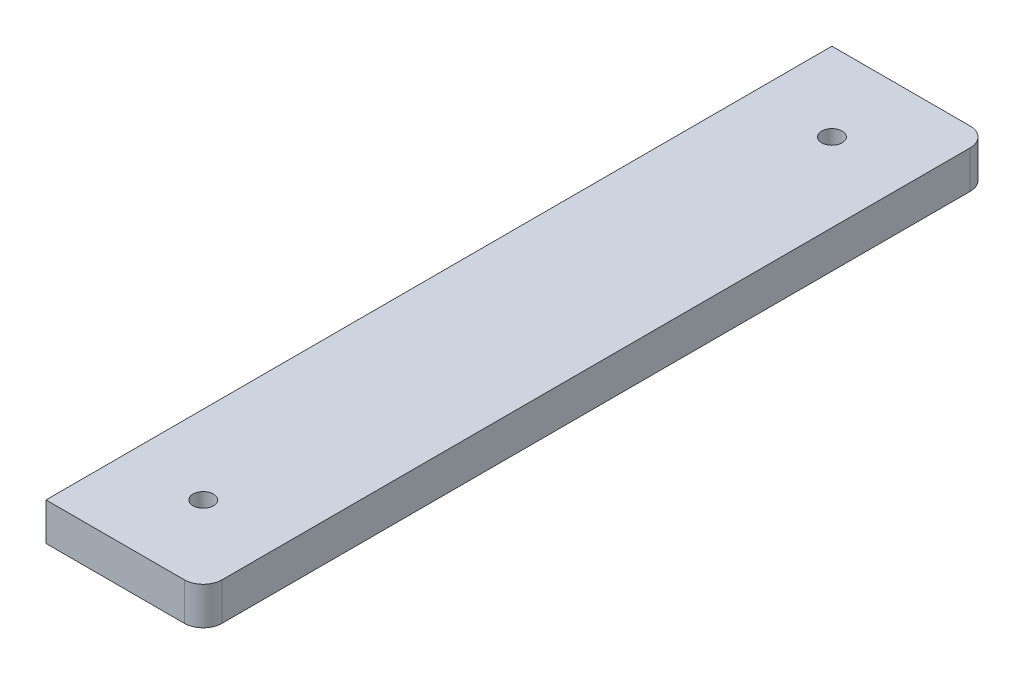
ISO-10303-21;
HEADER;
FILE_DESCRIPTION(('STEP AP214'),'2;1');
FILE_NAME('part.step','',(''),(''),'','','');
FILE_SCHEMA(('AUTOMOTIVE_DESIGN { 1 0 10303 214 1 1 1 1 }'));
ENDSEC;
DATA;
#1=APPLICATION_CONTEXT('core data for automotive mechanical design processes');
#2=APPLICATION_PROTOCOL_DEFINITION('international standard','automotive_design',2000,#1);
#3=PRODUCT_CONTEXT('',#1,'mechanical');
#4=PRODUCT('Part','Part','',(#3));
#5=PRODUCT_RELATED_PRODUCT_CATEGORY('part','',(#4));
#6=PRODUCT_DEFINITION_FORMATION('','',#4);
#7=PRODUCT_DEFINITION_CONTEXT('part definition',#1,'design');
#8=PRODUCT_DEFINITION('design','',#6,#7);
#9=PRODUCT_DEFINITION_SHAPE('','',#8);
#10=(LENGTH_UNIT() NAMED_UNIT(*) SI_UNIT(.MILLI.,.METRE.));
#11=(NAMED_UNIT(*) PLANE_ANGLE_UNIT() SI_UNIT($,.RADIAN.));
#12=(NAMED_UNIT(*) SI_UNIT($,.STERADIAN.) SOLID_ANGLE_UNIT());
#13=UNCERTAINTY_MEASURE_WITH_UNIT(LENGTH_MEASURE(1.E-05),#10,'distance_accuracy_value','');
#14=(GEOMETRIC_REPRESENTATION_CONTEXT(3) GLOBAL_UNCERTAINTY_ASSIGNED_CONTEXT((#13)) GLOBAL_UNIT_ASSIGNED_CONTEXT((#10,
#11,#12)) REPRESENTATION_CONTEXT('',''));
#15=CARTESIAN_POINT('',(0.,0.,0.));
#16=DIRECTION('',(0.,0.,1.));
#17=DIRECTION('',(1.,0.,0.));
#18=AXIS2_PLACEMENT_3D('',#15,#16,#17);
#19=CARTESIAN_POINT('',(0.,12.,0.));
#20=DIRECTION('',(1.,0.,0.));
#21=DIRECTION('',(0.,0.,-1.));
#22=AXIS2_PLACEMENT_3D('',#19,#20,#21);
#23=PLANE('',#22);
#24=DIRECTION('',(0.,0.,1.));
#25=VECTOR('',#24,1.);
#26=CARTESIAN_POINT('',(0.,0.,0.));
#27=LINE('',#26,#25);
#28=CARTESIAN_POINT('',(0.,0.,-250.));
#29=VERTEX_POINT('',#28);
#30=CARTESIAN_POINT('',(0.,0.,0.));
#31=VERTEX_POINT('',#30);
#32=EDGE_CURVE('E106',#29,#31,#27,.T.);
#33=ORIENTED_EDGE('',*,*,#32,.T.);
#34=DIRECTION('',(0.,-1.,0.));
#35=VECTOR('',#34,1.);
#36=CARTESIAN_POINT('',(0.,12.,0.));
#37=LINE('',#36,#35);
#38=CARTESIAN_POINT('',(0.,12.,0.));
#39=VERTEX_POINT('',#38);
#40=EDGE_CURVE('E89',#39,#31,#37,.T.);
#41=ORIENTED_EDGE('',*,*,#40,.F.);
#42=DIRECTION('',(0.,0.,1.));
#43=VECTOR('',#42,1.);
#44=CARTESIAN_POINT('',(0.,12.,0.));
#45=LINE('',#44,#43);
#46=CARTESIAN_POINT('',(0.,12.,-250.));
#47=VERTEX_POINT('',#46);
#48=EDGE_CURVE('E94',#47,#39,#45,.T.);
#49=ORIENTED_EDGE('',*,*,#48,.F.);
#50=DIRECTION('',(0.,-1.,0.));
#51=VECTOR('',#50,1.);
#52=CARTESIAN_POINT('',(0.,12.,-250.));
#53=LINE('',#52,#51);
#54=EDGE_CURVE('E108',#47,#29,#53,.T.);
#55=ORIENTED_EDGE('',*,*,#54,.T.);
#56=EDGE_LOOP('',(#33,#41,#49,#55));
#57=FACE_BOUND('',#56,.T.);
#58=ADVANCED_FACE('F33',(#57),#23,.F.);
#59=CARTESIAN_POINT('',(0.,12.,0.));
#60=DIRECTION('',(0.,0.,-1.));
#61=DIRECTION('',(-1.,0.,0.));
#62=AXIS2_PLACEMENT_3D('',#59,#60,#61);
#63=PLANE('',#62);
#64=DIRECTION('',(1.,0.,0.));
#65=VECTOR('',#64,1.);
#66=CARTESIAN_POINT('',(0.,0.,0.));
#67=LINE('',#66,#65);
#68=CARTESIAN_POINT('',(44.,0.,0.));
#69=VERTEX_POINT('',#68);
#70=EDGE_CURVE('E138',#31,#69,#67,.T.);
#71=ORIENTED_EDGE('',*,*,#70,.T.);
#72=DIRECTION('',(0.,-1.,0.));
#73=VECTOR('',#72,1.);
#74=CARTESIAN_POINT('',(44.,12.,0.));
#75=LINE('',#74,#73);
#76=CARTESIAN_POINT('',(44.,12.,0.));
#77=VERTEX_POINT('',#76);
#78=EDGE_CURVE('E11',#69,#77,#75,.F.);
#79=ORIENTED_EDGE('',*,*,#78,.T.);
#80=DIRECTION('',(1.,0.,0.));
#81=VECTOR('',#80,1.);
#82=CARTESIAN_POINT('',(0.,12.,0.));
#83=LINE('',#82,#81);
#84=EDGE_CURVE('E85',#39,#77,#83,.T.);
#85=ORIENTED_EDGE('',*,*,#84,.F.);
#86=ORIENTED_EDGE('',*,*,#40,.T.);
#87=EDGE_LOOP('',(#71,#79,#85,#86));
#88=FACE_BOUND('',#87,.T.);
#89=ADVANCED_FACE('F87',(#88),#63,.F.);
#90=CARTESIAN_POINT('',(50.,12.,0.));
#91=DIRECTION('',(-1.,0.,0.));
#92=DIRECTION('',(0.,0.,1.));
#93=AXIS2_PLACEMENT_3D('',#90,#91,#92);
#94=PLANE('',#93);
#95=DIRECTION('',(0.,0.,-1.));
#96=VECTOR('',#95,1.);
#97=CARTESIAN_POINT('',(50.,0.,0.));
#98=LINE('',#97,#96);
#99=CARTESIAN_POINT('',(50.,0.,-6.));
#100=VERTEX_POINT('',#99);
#101=CARTESIAN_POINT('',(50.,0.,-244.));
#102=VERTEX_POINT('',#101);
#103=EDGE_CURVE('E135',#100,#102,#98,.T.);
#104=ORIENTED_EDGE('',*,*,#103,.T.);
#105=DIRECTION('',(0.,-1.,0.));
#106=VECTOR('',#105,1.);
#107=CARTESIAN_POINT('',(50.,12.,-244.));
#108=LINE('',#107,#106);
#109=CARTESIAN_POINT('',(50.,12.,-244.));
#110=VERTEX_POINT('',#109);
#111=EDGE_CURVE('E54',#102,#110,#108,.F.);
#112=ORIENTED_EDGE('',*,*,#111,.T.);
#113=DIRECTION('',(0.,0.,-1.));
#114=VECTOR('',#113,1.);
#115=CARTESIAN_POINT('',(50.,12.,0.));
#116=LINE('',#115,#114);
#117=CARTESIAN_POINT('',(50.,12.,-6.));
#118=VERTEX_POINT('',#117);
#119=EDGE_CURVE('E93',#118,#110,#116,.T.);
#120=ORIENTED_EDGE('',*,*,#119,.F.);
#121=DIRECTION('',(0.,-1.,0.));
#122=VECTOR('',#121,1.);
#123=CARTESIAN_POINT('',(50.,12.,-6.));
#124=LINE('',#123,#122);
#125=EDGE_CURVE('E119',#118,#100,#124,.T.);
#126=ORIENTED_EDGE('',*,*,#125,.T.);
#127=EDGE_LOOP('',(#104,#112,#120,#126));
#128=FACE_BOUND('',#127,.T.);
#129=ADVANCED_FACE('F136',(#128),#94,.F.);
#130=CARTESIAN_POINT('',(0.,12.,-250.));
#131=DIRECTION('',(0.,0.,1.));
#132=DIRECTION('',(1.,0.,0.));
#133=AXIS2_PLACEMENT_3D('',#130,#131,#132);
#134=PLANE('',#133);
#135=DIRECTION('',(-1.,0.,0.));
#136=VECTOR('',#135,1.);
#137=CARTESIAN_POINT('',(0.,12.,-250.));
#138=LINE('',#137,#136);
#139=CARTESIAN_POINT('',(44.,12.,-250.));
#140=VERTEX_POINT('',#139);
#141=EDGE_CURVE('E99',#140,#47,#138,.T.);
#142=ORIENTED_EDGE('',*,*,#141,.F.);
#143=DIRECTION('',(0.,-1.,0.));
#144=VECTOR('',#143,1.);
#145=CARTESIAN_POINT('',(44.,12.,-250.));
#146=LINE('',#145,#144);
#147=CARTESIAN_POINT('',(44.,0.,-250.));
#148=VERTEX_POINT('',#147);
#149=EDGE_CURVE('E107',#140,#148,#146,.T.);
#150=ORIENTED_EDGE('',*,*,#149,.T.);
#151=DIRECTION('',(-1.,0.,0.));
#152=VECTOR('',#151,1.);
#153=CARTESIAN_POINT('',(0.,0.,-250.));
#154=LINE('',#153,#152);
#155=EDGE_CURVE('E103',#148,#29,#154,.T.);
#156=ORIENTED_EDGE('',*,*,#155,.T.);
#157=ORIENTED_EDGE('',*,*,#54,.F.);
#158=EDGE_LOOP('',(#142,#150,#156,#157));
#159=FACE_BOUND('',#158,.T.);
#160=ADVANCED_FACE('F128',(#159),#134,.F.);
#161=CARTESIAN_POINT('',(0.,12.,0.));
#162=DIRECTION('',(0.,-1.,0.));
#163=DIRECTION('',(0.,0.,-1.));
#164=AXIS2_PLACEMENT_3D('',#161,#162,#163);
#165=PLANE('',#164);
#166=CARTESIAN_POINT('',(25.,12.,-25.));
#167=DIRECTION('',(0.,1.,0.));
#168=DIRECTION('',(0.,0.,1.));
#169=AXIS2_PLACEMENT_3D('',#166,#167,#168);
#170=CIRCLE('',#169,3.25);
#171=CARTESIAN_POINT('',(25.,12.,-21.75));
#172=VERTEX_POINT('',#171);
#173=EDGE_CURVE('E151',#172,#172,#170,.T.);
#174=ORIENTED_EDGE('',*,*,#173,.F.);
#175=EDGE_LOOP('',(#174));
#176=FACE_BOUND('',#175,.T.);
#177=CARTESIAN_POINT('',(25.,12.,-225.));
#178=DIRECTION('',(0.,1.,0.));
#179=DIRECTION('',(0.,0.,1.));
#180=AXIS2_PLACEMENT_3D('',#177,#178,#179);
#181=CIRCLE('',#180,3.25);
#182=CARTESIAN_POINT('',(25.,12.,-221.75));
#183=VERTEX_POINT('',#182);
#184=EDGE_CURVE('E145',#183,#183,#181,.T.);
#185=ORIENTED_EDGE('',*,*,#184,.F.);
#186=EDGE_LOOP('',(#185));
#187=FACE_BOUND('',#186,.T.);
#188=ORIENTED_EDGE('',*,*,#119,.T.);
#189=CARTESIAN_POINT('',(44.,12.,-244.));
#190=DIRECTION('',(0.,-1.,0.));
#191=DIRECTION('',(0.,0.,-1.));
#192=AXIS2_PLACEMENT_3D('',#189,#190,#191);
#193=CIRCLE('',#192,6.);
#194=EDGE_CURVE('E41',#110,#140,#193,.F.);
#195=ORIENTED_EDGE('',*,*,#194,.T.);
#196=ORIENTED_EDGE('',*,*,#141,.T.);
#197=ORIENTED_EDGE('',*,*,#48,.T.);
#198=ORIENTED_EDGE('',*,*,#84,.T.);
#199=CARTESIAN_POINT('',(44.,12.,-6.));
#200=DIRECTION('',(0.,-1.,0.));
#201=DIRECTION('',(0.,0.,-1.));
#202=AXIS2_PLACEMENT_3D('',#199,#200,#201);
#203=CIRCLE('',#202,6.);
#204=EDGE_CURVE('E123',#77,#118,#203,.F.);
#205=ORIENTED_EDGE('',*,*,#204,.T.);
#206=EDGE_LOOP('',(#188,#195,#196,#197,#198,#205));
#207=FACE_BOUND('',#206,.T.);
#208=ADVANCED_FACE('F97',(#176,#187,#207),#165,.F.);
#209=CARTESIAN_POINT('',(0.,0.,0.));
#210=DIRECTION('',(0.,-1.,0.));
#211=DIRECTION('',(0.,0.,-1.));
#212=AXIS2_PLACEMENT_3D('',#209,#210,#211);
#213=PLANE('',#212);
#214=CARTESIAN_POINT('',(25.,0.,-25.));
#215=DIRECTION('',(0.,1.,0.));
#216=DIRECTION('',(0.,0.,1.));
#217=AXIS2_PLACEMENT_3D('',#214,#215,#216);
#218=CIRCLE('',#217,3.25);
#219=CARTESIAN_POINT('',(25.,0.,-21.75));
#220=VERTEX_POINT('',#219);
#221=EDGE_CURVE('E148',#220,#220,#218,.T.);
#222=ORIENTED_EDGE('',*,*,#221,.T.);
#223=EDGE_LOOP('',(#222));
#224=FACE_BOUND('',#223,.T.);
#225=CARTESIAN_POINT('',(25.,0.,-225.));
#226=DIRECTION('',(0.,1.,0.));
#227=DIRECTION('',(0.,0.,1.));
#228=AXIS2_PLACEMENT_3D('',#225,#226,#227);
#229=CIRCLE('',#228,3.25);
#230=CARTESIAN_POINT('',(25.,0.,-221.75));
#231=VERTEX_POINT('',#230);
#232=EDGE_CURVE('E142',#231,#231,#229,.T.);
#233=ORIENTED_EDGE('',*,*,#232,.T.);
#234=EDGE_LOOP('',(#233));
#235=FACE_BOUND('',#234,.T.);
#236=ORIENTED_EDGE('',*,*,#155,.F.);
#237=CARTESIAN_POINT('',(44.,0.,-244.));
#238=DIRECTION('',(0.,-1.,0.));
#239=DIRECTION('',(0.,0.,-1.));
#240=AXIS2_PLACEMENT_3D('',#237,#238,#239);
#241=CIRCLE('',#240,6.);
#242=EDGE_CURVE('E117',#148,#102,#241,.T.);
#243=ORIENTED_EDGE('',*,*,#242,.T.);
#244=ORIENTED_EDGE('',*,*,#103,.F.);
#245=CARTESIAN_POINT('',(44.,0.,-6.));
#246=DIRECTION('',(0.,-1.,0.));
#247=DIRECTION('',(0.,0.,-1.));
#248=AXIS2_PLACEMENT_3D('',#245,#246,#247);
#249=CIRCLE('',#248,6.);
#250=EDGE_CURVE('E111',#100,#69,#249,.T.);
#251=ORIENTED_EDGE('',*,*,#250,.T.);
#252=ORIENTED_EDGE('',*,*,#70,.F.);
#253=ORIENTED_EDGE('',*,*,#32,.F.);
#254=EDGE_LOOP('',(#236,#243,#244,#251,#252,#253));
#255=FACE_BOUND('',#254,.T.);
#256=ADVANCED_FACE('F134',(#224,#235,#255),#213,.T.);
#257=CARTESIAN_POINT('',(44.,12.,-244.));
#258=DIRECTION('',(0.,-1.,0.));
#259=DIRECTION('',(0.,0.,-1.));
#260=AXIS2_PLACEMENT_3D('',#257,#258,#259);
#261=CYLINDRICAL_SURFACE('',#260,6.);
#262=ORIENTED_EDGE('',*,*,#194,.F.);
#263=ORIENTED_EDGE('',*,*,#111,.F.);
#264=ORIENTED_EDGE('',*,*,#242,.F.);
#265=ORIENTED_EDGE('',*,*,#149,.F.);
#266=EDGE_LOOP('',(#262,#263,#264,#265));
#267=FACE_BOUND('',#266,.T.);
#268=ADVANCED_FACE('F131',(#267),#261,.T.);
#269=CARTESIAN_POINT('',(44.,12.,-6.));
#270=DIRECTION('',(0.,-1.,0.));
#271=DIRECTION('',(0.,0.,-1.));
#272=AXIS2_PLACEMENT_3D('',#269,#270,#271);
#273=CYLINDRICAL_SURFACE('',#272,6.);
#274=ORIENTED_EDGE('',*,*,#204,.F.);
#275=ORIENTED_EDGE('',*,*,#78,.F.);
#276=ORIENTED_EDGE('',*,*,#250,.F.);
#277=ORIENTED_EDGE('',*,*,#125,.F.);
#278=EDGE_LOOP('',(#274,#275,#276,#277));
#279=FACE_BOUND('',#278,.T.);
#280=ADVANCED_FACE('F35',(#279),#273,.T.);
#281=CARTESIAN_POINT('',(25.,0.,-225.));
#282=DIRECTION('',(0.,1.,0.));
#283=DIRECTION('',(0.,0.,1.));
#284=AXIS2_PLACEMENT_3D('',#281,#282,#283);
#285=CYLINDRICAL_SURFACE('',#284,3.25);
#286=ORIENTED_EDGE('',*,*,#232,.F.);
#287=EDGE_LOOP('',(#286));
#288=FACE_BOUND('',#287,.T.);
#289=ORIENTED_EDGE('',*,*,#184,.T.);
#290=EDGE_LOOP('',(#289));
#291=FACE_BOUND('',#290,.T.);
#292=ADVANCED_FACE('F162',(#288,#291),#285,.F.);
#293=CARTESIAN_POINT('',(25.,0.,-25.));
#294=DIRECTION('',(0.,1.,0.));
#295=DIRECTION('',(0.,0.,1.));
#296=AXIS2_PLACEMENT_3D('',#293,#294,#295);
#297=CYLINDRICAL_SURFACE('',#296,3.25);
#298=ORIENTED_EDGE('',*,*,#221,.F.);
#299=EDGE_LOOP('',(#298));
#300=FACE_BOUND('',#299,.T.);
#301=ORIENTED_EDGE('',*,*,#173,.T.);
#302=EDGE_LOOP('',(#301));
#303=FACE_BOUND('',#302,.T.);
#304=ADVANCED_FACE('F159',(#300,#303),#297,.F.);
#305=CLOSED_SHELL('',(#58,#89,#129,#160,#208,#256,#268,#280,#292,#304));
#306=MANIFOLD_SOLID_BREP('B2',#305);
#307=ADVANCED_BREP_SHAPE_REPRESENTATION('',(#18,#306),#14);
#308=SHAPE_DEFINITION_REPRESENTATION(#9,#307);
ENDSEC;
END-ISO-10303-21;
